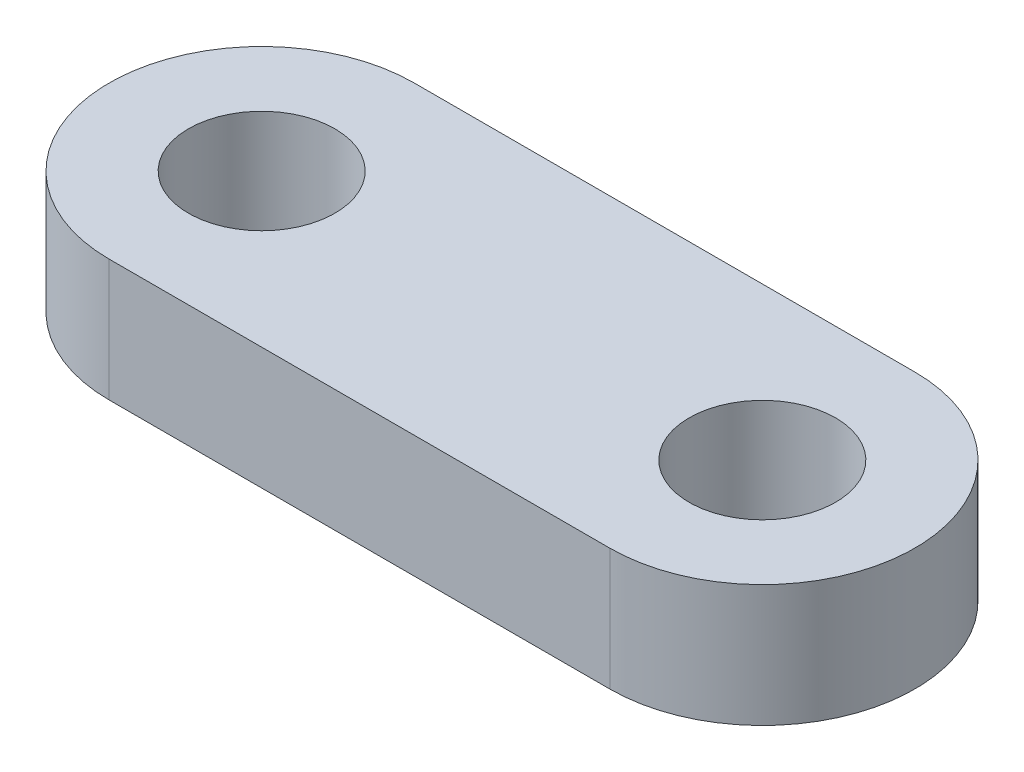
ISO-10303-21;
HEADER;
FILE_DESCRIPTION(('STEP AP214'),'2;1');
FILE_NAME('part.step','',(''),(''),'','','');
FILE_SCHEMA(('AUTOMOTIVE_DESIGN { 1 0 10303 214 1 1 1 1 }'));
ENDSEC;
DATA;
#1=APPLICATION_CONTEXT('core data for automotive mechanical design processes');
#2=APPLICATION_PROTOCOL_DEFINITION('international standard','automotive_design',2000,#1);
#3=PRODUCT_CONTEXT('',#1,'mechanical');
#4=PRODUCT('Part','Part','',(#3));
#5=PRODUCT_RELATED_PRODUCT_CATEGORY('part','',(#4));
#6=PRODUCT_DEFINITION_FORMATION('','',#4);
#7=PRODUCT_DEFINITION_CONTEXT('part definition',#1,'design');
#8=PRODUCT_DEFINITION('design','',#6,#7);
#9=PRODUCT_DEFINITION_SHAPE('','',#8);
#10=(LENGTH_UNIT() NAMED_UNIT(*) SI_UNIT(.MILLI.,.METRE.));
#11=(NAMED_UNIT(*) PLANE_ANGLE_UNIT() SI_UNIT($,.RADIAN.));
#12=(NAMED_UNIT(*) SI_UNIT($,.STERADIAN.) SOLID_ANGLE_UNIT());
#13=UNCERTAINTY_MEASURE_WITH_UNIT(LENGTH_MEASURE(1.E-05),#10,'distance_accuracy_value','');
#14=(GEOMETRIC_REPRESENTATION_CONTEXT(3) GLOBAL_UNCERTAINTY_ASSIGNED_CONTEXT((#13)) GLOBAL_UNIT_ASSIGNED_CONTEXT((#10,
#11,#12)) REPRESENTATION_CONTEXT('',''));
#15=CARTESIAN_POINT('',(0.,0.,0.));
#16=DIRECTION('',(0.,0.,1.));
#17=DIRECTION('',(1.,0.,0.));
#18=AXIS2_PLACEMENT_3D('',#15,#16,#17);
#19=CARTESIAN_POINT('',(41.03,5.,0.));
#20=DIRECTION('',(0.,-1.,0.));
#21=DIRECTION('',(0.,0.,1.));
#22=AXIS2_PLACEMENT_3D('',#19,#20,#21);
#23=PLANE('',#22);
#24=CARTESIAN_POINT('',(41.03,5.,0.));
#25=DIRECTION('',(0.,-1.,0.));
#26=DIRECTION('',(0.,0.,1.));
#27=AXIS2_PLACEMENT_3D('',#24,#25,#26);
#28=CIRCLE('',#27,12.5);
#29=CARTESIAN_POINT('',(41.03,5.,-12.5));
#30=VERTEX_POINT('',#29);
#31=CARTESIAN_POINT('',(41.03,5.,12.5));
#32=VERTEX_POINT('',#31);
#33=EDGE_CURVE('E109',#30,#32,#28,.T.);
#34=ORIENTED_EDGE('',*,*,#33,.F.);
#35=DIRECTION('',(1.,0.,0.));
#36=VECTOR('',#35,1.);
#37=CARTESIAN_POINT('',(0.,5.,-12.5));
#38=LINE('',#37,#36);
#39=CARTESIAN_POINT('',(0.,5.,-12.5));
#40=VERTEX_POINT('',#39);
#41=EDGE_CURVE('E9',#40,#30,#38,.T.);
#42=ORIENTED_EDGE('',*,*,#41,.F.);
#43=CARTESIAN_POINT('',(0.,5.,0.));
#44=DIRECTION('',(0.,-1.,0.));
#45=DIRECTION('',(0.,0.,1.));
#46=AXIS2_PLACEMENT_3D('',#43,#44,#45);
#47=CIRCLE('',#46,12.5);
#48=CARTESIAN_POINT('',(0.,5.,12.5));
#49=VERTEX_POINT('',#48);
#50=EDGE_CURVE('E84',#49,#40,#47,.T.);
#51=ORIENTED_EDGE('',*,*,#50,.F.);
#52=DIRECTION('',(-1.,0.,0.));
#53=VECTOR('',#52,1.);
#54=CARTESIAN_POINT('',(41.03,5.,12.5));
#55=LINE('',#54,#53);
#56=EDGE_CURVE('E80',#32,#49,#55,.T.);
#57=ORIENTED_EDGE('',*,*,#56,.F.);
#58=EDGE_LOOP('',(#34,#42,#51,#57));
#59=FACE_BOUND('',#58,.T.);
#60=CARTESIAN_POINT('',(0.,5.,0.));
#61=DIRECTION('',(0.,-1.,0.));
#62=DIRECTION('',(0.512775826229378,0.,0.858522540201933));
#63=AXIS2_PLACEMENT_3D('',#60,#61,#62);
#64=CIRCLE('',#63,6.);
#65=CARTESIAN_POINT('',(3.07665495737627,5.,5.1511352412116));
#66=VERTEX_POINT('',#65);
#67=EDGE_CURVE('E99',#66,#66,#64,.F.);
#68=ORIENTED_EDGE('',*,*,#67,.F.);
#69=EDGE_LOOP('',(#68));
#70=FACE_BOUND('',#69,.T.);
#71=CARTESIAN_POINT('',(41.03,5.,0.));
#72=DIRECTION('',(0.,-1.,0.));
#73=DIRECTION('',(0.512775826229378,0.,0.858522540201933));
#74=AXIS2_PLACEMENT_3D('',#71,#72,#73);
#75=CIRCLE('',#74,6.);
#76=CARTESIAN_POINT('',(44.1066549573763,5.,5.15113524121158));
#77=VERTEX_POINT('',#76);
#78=EDGE_CURVE('E122',#77,#77,#75,.F.);
#79=ORIENTED_EDGE('',*,*,#78,.F.);
#80=EDGE_LOOP('',(#79));
#81=FACE_BOUND('',#80,.T.);
#82=ADVANCED_FACE('F14',(#59,#70,#81),#23,.F.);
#83=CARTESIAN_POINT('',(0.,0.,-12.5));
#84=DIRECTION('',(0.,0.,1.));
#85=DIRECTION('',(1.,0.,0.));
#86=AXIS2_PLACEMENT_3D('',#83,#84,#85);
#87=PLANE('',#86);
#88=ORIENTED_EDGE('',*,*,#41,.T.);
#89=DIRECTION('',(0.,1.,0.));
#90=VECTOR('',#89,1.);
#91=CARTESIAN_POINT('',(41.03,0.,-12.5));
#92=LINE('',#91,#90);
#93=CARTESIAN_POINT('',(41.03,-5.,-12.5));
#94=VERTEX_POINT('',#93);
#95=EDGE_CURVE('E64',#94,#30,#92,.T.);
#96=ORIENTED_EDGE('',*,*,#95,.F.);
#97=DIRECTION('',(1.,0.,0.));
#98=VECTOR('',#97,1.);
#99=CARTESIAN_POINT('',(0.,-5.,-12.5));
#100=LINE('',#99,#98);
#101=CARTESIAN_POINT('',(0.,-5.,-12.5));
#102=VERTEX_POINT('',#101);
#103=EDGE_CURVE('E18',#102,#94,#100,.T.);
#104=ORIENTED_EDGE('',*,*,#103,.F.);
#105=DIRECTION('',(0.,1.,0.));
#106=VECTOR('',#105,1.);
#107=CARTESIAN_POINT('',(0.,0.,-12.5));
#108=LINE('',#107,#106);
#109=EDGE_CURVE('E25',#102,#40,#108,.T.);
#110=ORIENTED_EDGE('',*,*,#109,.T.);
#111=EDGE_LOOP('',(#88,#96,#104,#110));
#112=FACE_BOUND('',#111,.T.);
#113=ADVANCED_FACE('F145',(#112),#87,.F.);
#114=CARTESIAN_POINT('',(0.,0.,0.));
#115=DIRECTION('',(0.,1.,0.));
#116=DIRECTION('',(0.,0.,-1.));
#117=AXIS2_PLACEMENT_3D('',#114,#115,#116);
#118=CYLINDRICAL_SURFACE('',#117,12.5);
#119=ORIENTED_EDGE('',*,*,#50,.T.);
#120=ORIENTED_EDGE('',*,*,#109,.F.);
#121=CARTESIAN_POINT('',(0.,-5.,0.));
#122=DIRECTION('',(0.,-1.,0.));
#123=DIRECTION('',(0.,0.,1.));
#124=AXIS2_PLACEMENT_3D('',#121,#122,#123);
#125=CIRCLE('',#124,12.5);
#126=CARTESIAN_POINT('',(0.,-5.,12.5));
#127=VERTEX_POINT('',#126);
#128=EDGE_CURVE('E87',#127,#102,#125,.T.);
#129=ORIENTED_EDGE('',*,*,#128,.F.);
#130=DIRECTION('',(0.,1.,0.));
#131=VECTOR('',#130,1.);
#132=CARTESIAN_POINT('',(0.,0.,12.5));
#133=LINE('',#132,#131);
#134=EDGE_CURVE('E73',#127,#49,#133,.T.);
#135=ORIENTED_EDGE('',*,*,#134,.T.);
#136=EDGE_LOOP('',(#119,#120,#129,#135));
#137=FACE_BOUND('',#136,.T.);
#138=ADVANCED_FACE('F88',(#137),#118,.T.);
#139=CARTESIAN_POINT('',(41.03,0.,12.5));
#140=DIRECTION('',(0.,0.,-1.));
#141=DIRECTION('',(-1.,0.,0.));
#142=AXIS2_PLACEMENT_3D('',#139,#140,#141);
#143=PLANE('',#142);
#144=ORIENTED_EDGE('',*,*,#56,.T.);
#145=ORIENTED_EDGE('',*,*,#134,.F.);
#146=DIRECTION('',(-1.,0.,0.));
#147=VECTOR('',#146,1.);
#148=CARTESIAN_POINT('',(41.03,-5.,12.5));
#149=LINE('',#148,#147);
#150=CARTESIAN_POINT('',(41.03,-5.,12.5));
#151=VERTEX_POINT('',#150);
#152=EDGE_CURVE('E78',#151,#127,#149,.T.);
#153=ORIENTED_EDGE('',*,*,#152,.F.);
#154=DIRECTION('',(0.,1.,0.));
#155=VECTOR('',#154,1.);
#156=CARTESIAN_POINT('',(41.03,0.,12.5));
#157=LINE('',#156,#155);
#158=EDGE_CURVE('E106',#151,#32,#157,.T.);
#159=ORIENTED_EDGE('',*,*,#158,.T.);
#160=EDGE_LOOP('',(#144,#145,#153,#159));
#161=FACE_BOUND('',#160,.T.);
#162=ADVANCED_FACE('F75',(#161),#143,.F.);
#163=CARTESIAN_POINT('',(41.03,0.,0.));
#164=DIRECTION('',(0.,1.,0.));
#165=DIRECTION('',(0.,0.,-1.));
#166=AXIS2_PLACEMENT_3D('',#163,#164,#165);
#167=CYLINDRICAL_SURFACE('',#166,12.5);
#168=ORIENTED_EDGE('',*,*,#33,.T.);
#169=ORIENTED_EDGE('',*,*,#158,.F.);
#170=CARTESIAN_POINT('',(41.03,-5.,0.));
#171=DIRECTION('',(0.,-1.,0.));
#172=DIRECTION('',(0.,0.,1.));
#173=AXIS2_PLACEMENT_3D('',#170,#171,#172);
#174=CIRCLE('',#173,12.5);
#175=EDGE_CURVE('E93',#94,#151,#174,.T.);
#176=ORIENTED_EDGE('',*,*,#175,.F.);
#177=ORIENTED_EDGE('',*,*,#95,.T.);
#178=EDGE_LOOP('',(#168,#169,#176,#177));
#179=FACE_BOUND('',#178,.T.);
#180=ADVANCED_FACE('F133',(#179),#167,.T.);
#181=CARTESIAN_POINT('',(41.03,-5.,0.));
#182=DIRECTION('',(0.,-1.,0.));
#183=DIRECTION('',(0.,0.,1.));
#184=AXIS2_PLACEMENT_3D('',#181,#182,#183);
#185=PLANE('',#184);
#186=ORIENTED_EDGE('',*,*,#175,.T.);
#187=ORIENTED_EDGE('',*,*,#152,.T.);
#188=ORIENTED_EDGE('',*,*,#128,.T.);
#189=ORIENTED_EDGE('',*,*,#103,.T.);
#190=EDGE_LOOP('',(#186,#187,#188,#189));
#191=FACE_BOUND('',#190,.T.);
#192=CARTESIAN_POINT('',(0.,-5.,0.));
#193=DIRECTION('',(0.,-1.,0.));
#194=DIRECTION('',(0.512775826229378,0.,0.858522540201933));
#195=AXIS2_PLACEMENT_3D('',#192,#193,#194);
#196=CIRCLE('',#195,6.);
#197=CARTESIAN_POINT('',(3.07665495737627,-5.,5.1511352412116));
#198=VERTEX_POINT('',#197);
#199=EDGE_CURVE('E119',#198,#198,#196,.T.);
#200=ORIENTED_EDGE('',*,*,#199,.F.);
#201=EDGE_LOOP('',(#200));
#202=FACE_BOUND('',#201,.T.);
#203=CARTESIAN_POINT('',(41.03,-5.,0.));
#204=DIRECTION('',(0.,-1.,0.));
#205=DIRECTION('',(0.512775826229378,0.,0.858522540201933));
#206=AXIS2_PLACEMENT_3D('',#203,#204,#205);
#207=CIRCLE('',#206,6.);
#208=CARTESIAN_POINT('',(44.1066549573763,-5.,5.15113524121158));
#209=VERTEX_POINT('',#208);
#210=EDGE_CURVE('E125',#209,#209,#207,.T.);
#211=ORIENTED_EDGE('',*,*,#210,.F.);
#212=EDGE_LOOP('',(#211));
#213=FACE_BOUND('',#212,.T.);
#214=ADVANCED_FACE('F16',(#191,#202,#213),#185,.T.);
#215=CARTESIAN_POINT('',(0.,0.,0.));
#216=DIRECTION('',(0.,-1.,0.));
#217=DIRECTION('',(0.,0.,1.));
#218=AXIS2_PLACEMENT_3D('',#215,#216,#217);
#219=CYLINDRICAL_SURFACE('',#218,6.);
#220=ORIENTED_EDGE('',*,*,#67,.T.);
#221=EDGE_LOOP('',(#220));
#222=FACE_BOUND('',#221,.T.);
#223=ORIENTED_EDGE('',*,*,#199,.T.);
#224=EDGE_LOOP('',(#223));
#225=FACE_BOUND('',#224,.T.);
#226=ADVANCED_FACE('F132',(#222,#225),#219,.F.);
#227=CARTESIAN_POINT('',(41.03,0.,0.));
#228=DIRECTION('',(0.,-1.,0.));
#229=DIRECTION('',(0.,0.,1.));
#230=AXIS2_PLACEMENT_3D('',#227,#228,#229);
#231=CYLINDRICAL_SURFACE('',#230,6.);
#232=ORIENTED_EDGE('',*,*,#78,.T.);
#233=EDGE_LOOP('',(#232));
#234=FACE_BOUND('',#233,.T.);
#235=ORIENTED_EDGE('',*,*,#210,.T.);
#236=EDGE_LOOP('',(#235));
#237=FACE_BOUND('',#236,.T.);
#238=ADVANCED_FACE('F129',(#234,#237),#231,.F.);
#239=CLOSED_SHELL('',(#82,#113,#138,#162,#180,#214,#226,#238));
#240=MANIFOLD_SOLID_BREP('B1',#239);
#241=ADVANCED_BREP_SHAPE_REPRESENTATION('',(#18,#240),#14);
#242=SHAPE_DEFINITION_REPRESENTATION(#9,#241);
ENDSEC;
END-ISO-10303-21;
